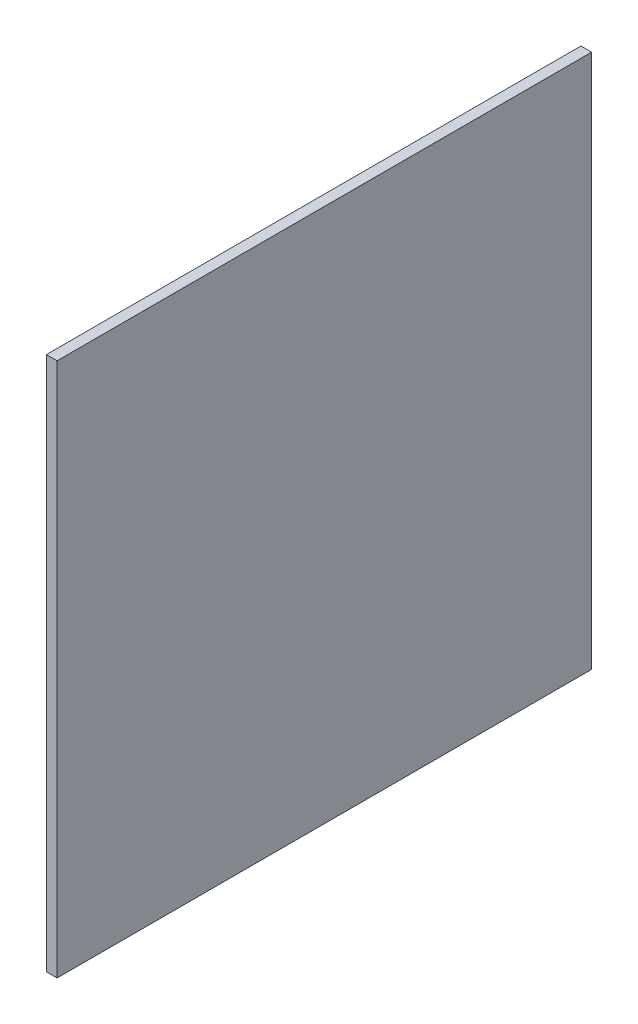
from build123d import *

# Parameters (mm, degrees)
SKETCH_1_W      = 500
SKETCH_1_H      = 500
EXTRUDE_1_DEPTH = 10


with BuildPart() as part:
    # Sketch 1 → Extrude 1 (new body)
    with BuildSketch(Plane.YZ):
        Rectangle(SKETCH_1_W, SKETCH_1_H)
    extrude(amount=EXTRUDE_1_DEPTH)


solid = part.part
